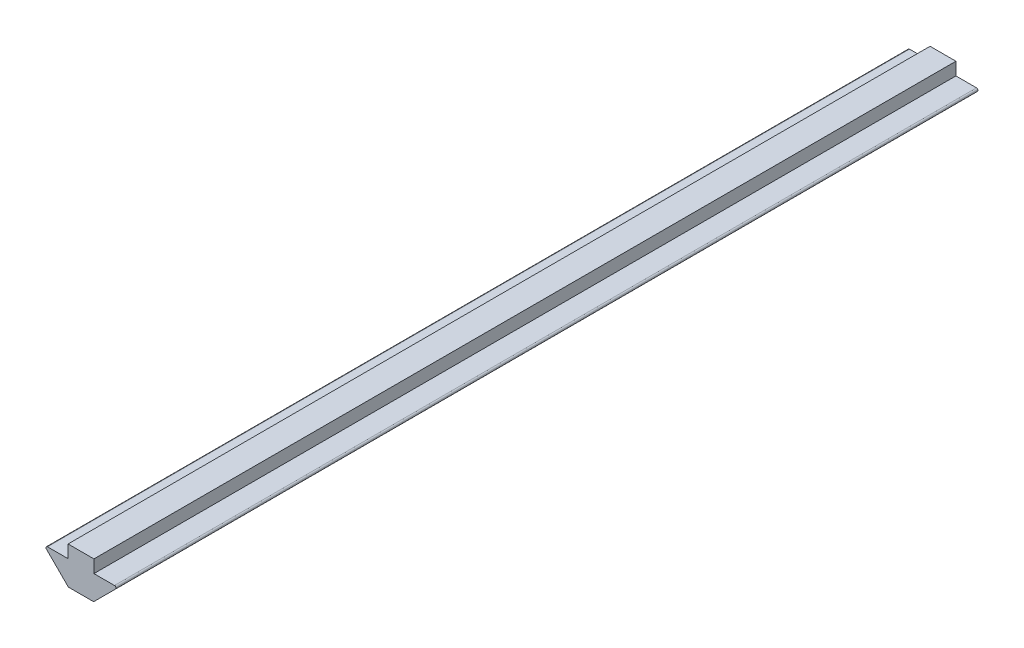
from build123d import *

# Parameters (mm, degrees)
BOSS_EXTRUDE1_DEPTH = 171.700000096
SKETCH4_W           = 5.15
SKETCH4_H           = 171.700000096
BOSS_EXTRUDE2_DEPTH = 2.54


with BuildPart() as part:
    # Sketch1 → Boss-Extrude1 (new body)
    with BuildSketch(Plane.XY):
        with BuildLine():
            Line((2.516497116, 3.86), (6.88370491, 8.227207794))
            ThreePointArc((6.88370491, 8.227207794), (6.948736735, 8.554144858), (6.671572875, 8.739339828))
            Line((6.671572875, 8.739339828), (2.88, 8.739339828))
            Line((2.88, 8.739339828), (-6.671572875, 8.739339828))
            ThreePointArc((-6.671572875, 8.739339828), (-6.948736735, 8.554144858), (-6.88370491, 8.227207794))
            Line((-6.88370491, 8.227207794), (-2.516497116, 3.86))
            Line((-2.516497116, 3.86), (2.516497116, 3.86))
        make_face()
    extrude(amount=-BOSS_EXTRUDE1_DEPTH)

    # Sketch4 → Boss-Extrude2 (add)
    with BuildSketch(Plane(origin=(0, 8.739339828, 0), x_dir=(1, 0, 0), z_dir=(0, 1, 0))):
        with Locations((0, 85.850000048)):
            Rectangle(SKETCH4_W, SKETCH4_H)
    extrude(amount=BOSS_EXTRUDE2_DEPTH)


solid = part.part
